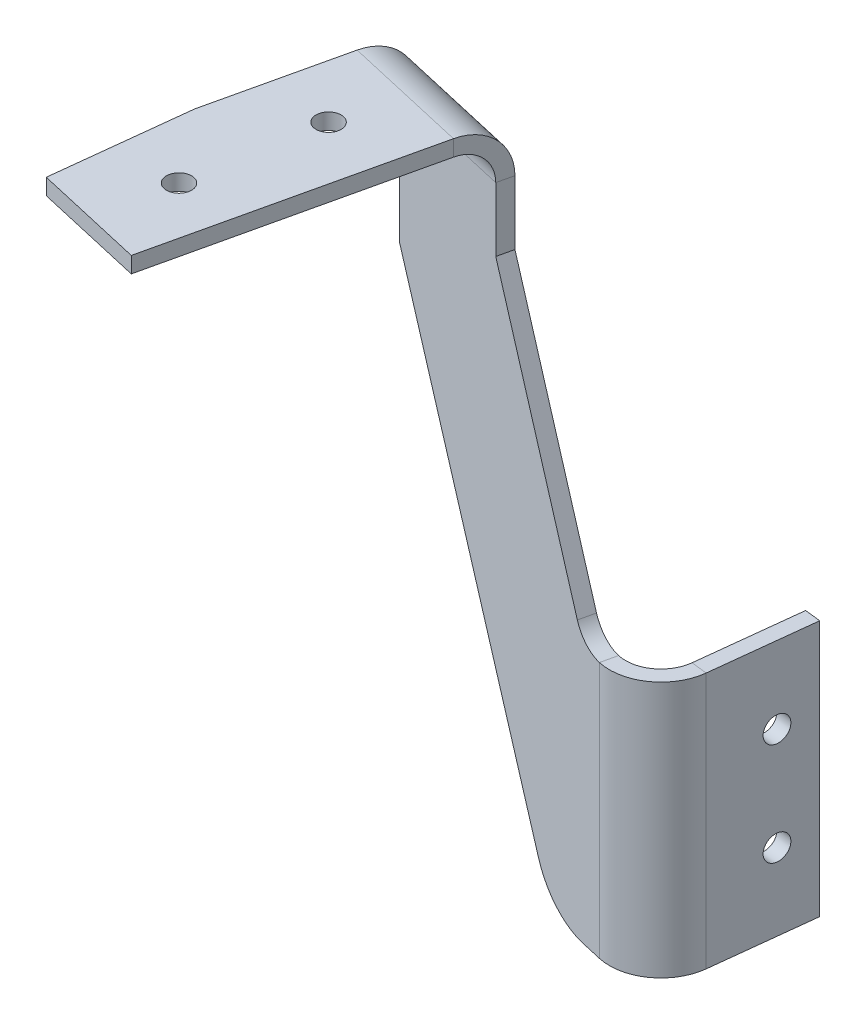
ISO-10303-21;
HEADER;
FILE_DESCRIPTION(('STEP AP214'),'2;1');
FILE_NAME('part.step','',(''),(''),'','','');
FILE_SCHEMA(('AUTOMOTIVE_DESIGN { 1 0 10303 214 1 1 1 1 }'));
ENDSEC;
DATA;
#1=APPLICATION_CONTEXT('core data for automotive mechanical design processes');
#2=APPLICATION_PROTOCOL_DEFINITION('international standard','automotive_design',2000,#1);
#3=PRODUCT_CONTEXT('',#1,'mechanical');
#4=PRODUCT('Part','Part','',(#3));
#5=PRODUCT_RELATED_PRODUCT_CATEGORY('part','',(#4));
#6=PRODUCT_DEFINITION_FORMATION('','',#4);
#7=PRODUCT_DEFINITION_CONTEXT('part definition',#1,'design');
#8=PRODUCT_DEFINITION('design','',#6,#7);
#9=PRODUCT_DEFINITION_SHAPE('','',#8);
#10=(LENGTH_UNIT() NAMED_UNIT(*) SI_UNIT(.MILLI.,.METRE.));
#11=(NAMED_UNIT(*) PLANE_ANGLE_UNIT() SI_UNIT($,.RADIAN.));
#12=(NAMED_UNIT(*) SI_UNIT($,.STERADIAN.) SOLID_ANGLE_UNIT());
#13=UNCERTAINTY_MEASURE_WITH_UNIT(LENGTH_MEASURE(1.E-05),#10,'distance_accuracy_value','');
#14=(GEOMETRIC_REPRESENTATION_CONTEXT(3) GLOBAL_UNCERTAINTY_ASSIGNED_CONTEXT((#13)) GLOBAL_UNIT_ASSIGNED_CONTEXT((#10,
#11,#12)) REPRESENTATION_CONTEXT('',''));
#15=CARTESIAN_POINT('',(0.,0.,0.));
#16=DIRECTION('',(0.,0.,1.));
#17=DIRECTION('',(1.,0.,0.));
#18=AXIS2_PLACEMENT_3D('',#15,#16,#17);
#19=CARTESIAN_POINT('',(-87.3403864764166,101.6,47.6895179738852));
#20=DIRECTION('',(-0.97483906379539,0.,-0.222909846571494));
#21=DIRECTION('',(0.222909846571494,0.,-0.97483906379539));
#22=AXIS2_PLACEMENT_3D('',#19,#20,#21);
#23=PLANE('',#22);
#24=DIRECTION('',(-0.222909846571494,0.,0.97483906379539));
#25=VECTOR('',#24,1.);
#26=CARTESIAN_POINT('',(-87.3403864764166,101.6,47.6895179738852));
#27=LINE('',#26,#25);
#28=CARTESIAN_POINT('',(-75.4537189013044,101.6,-4.29377513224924));
#29=VERTEX_POINT('',#28);
#30=CARTESIAN_POINT('',(-81.4497000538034,101.6,21.9281111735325));
#31=VERTEX_POINT('',#30);
#32=EDGE_CURVE('E179',#29,#31,#27,.T.);
#33=ORIENTED_EDGE('',*,*,#32,.F.);
#34=DIRECTION('',(0.,1.,0.));
#35=VECTOR('',#34,1.);
#36=CARTESIAN_POINT('',(-75.4537189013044,101.6,-4.29377513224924));
#37=LINE('',#36,#35);
#38=CARTESIAN_POINT('',(-75.4537189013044,98.4250000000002,-4.29377513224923));
#39=VERTEX_POINT('',#38);
#40=EDGE_CURVE('E209',#39,#29,#37,.T.);
#41=ORIENTED_EDGE('',*,*,#40,.F.);
#42=DIRECTION('',(0.222909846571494,0.,-0.97483906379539));
#43=VECTOR('',#42,1.);
#44=CARTESIAN_POINT('',(-73.1856112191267,98.4250000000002,-14.2127625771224));
#45=LINE('',#44,#43);
#46=CARTESIAN_POINT('',(-81.4497000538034,98.4250000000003,21.9281111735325));
#47=VERTEX_POINT('',#46);
#48=EDGE_CURVE('E181',#39,#47,#45,.F.);
#49=ORIENTED_EDGE('',*,*,#48,.T.);
#50=DIRECTION('',(0.,-1.,0.));
#51=VECTOR('',#50,1.);
#52=CARTESIAN_POINT('',(-81.4497000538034,98.4250000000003,21.9281111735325));
#53=LINE('',#52,#51);
#54=EDGE_CURVE('E167',#47,#31,#53,.F.);
#55=ORIENTED_EDGE('',*,*,#54,.T.);
#56=EDGE_LOOP('',(#33,#41,#49,#55));
#57=FACE_BOUND('',#56,.T.);
#58=ADVANCED_FACE('F39',(#57),#23,.T.);
#59=CARTESIAN_POINT('',(-21.7819574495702,101.6,-2.45863720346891));
#60=DIRECTION('',(0.,1.,0.));
#61=DIRECTION('',(-0.222909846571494,0.,0.97483906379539));
#62=AXIS2_PLACEMENT_3D('',#59,#60,#61);
#63=PLANE('',#62);
#64=CARTESIAN_POINT('',(-70.2788475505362,101.6,36.1898699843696));
#65=DIRECTION('',(0.,1.,0.));
#66=DIRECTION('',(0.222909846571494,0.,-0.97483906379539));
#67=AXIS2_PLACEMENT_3D('',#64,#65,#66);
#68=CIRCLE('',#67,2.4892);
#69=CARTESIAN_POINT('',(-69.7239803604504,101.6,33.7633005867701));
#70=VERTEX_POINT('',#69);
#71=EDGE_CURVE('E182',#70,#70,#68,.T.);
#72=ORIENTED_EDGE('',*,*,#71,.F.);
#73=EDGE_LOOP('',(#72));
#74=FACE_BOUND('',#73,.T.);
#75=CARTESIAN_POINT('',(-65.9042178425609,101.6,10.9176360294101));
#76=DIRECTION('',(0.,-1.,0.));
#77=DIRECTION('',(-0.222909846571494,0.,0.97483906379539));
#78=AXIS2_PLACEMENT_3D('',#75,#76,#77);
#79=CIRCLE('',#78,2.4892);
#80=CARTESIAN_POINT('',(-66.4590850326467,101.6,13.3442054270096));
#81=VERTEX_POINT('',#80);
#82=EDGE_CURVE('E289',#81,#81,#79,.T.);
#83=ORIENTED_EDGE('',*,*,#82,.T.);
#84=EDGE_LOOP('',(#83));
#85=FACE_BOUND('',#84,.T.);
#86=DIRECTION('',(0.97483906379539,0.,0.222909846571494));
#87=VECTOR('',#86,1.);
#88=CARTESIAN_POINT('',(-62.5794742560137,101.6,53.3514280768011));
#89=LINE('',#88,#87);
#90=CARTESIAN_POINT('',(-84.432569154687,101.6,48.354428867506));
#91=VERTEX_POINT('',#90);
#92=CARTESIAN_POINT('',(-62.5794742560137,101.6,53.3514280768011));
#93=VERTEX_POINT('',#92);
#94=EDGE_CURVE('E190',#91,#93,#89,.T.);
#95=ORIENTED_EDGE('',*,*,#94,.T.);
#96=DIRECTION('',(0.222909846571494,0.,-0.97483906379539));
#97=VECTOR('',#96,1.);
#98=CARTESIAN_POINT('',(-49.1324377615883,101.6,-5.45573844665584));
#99=LINE('',#98,#97);
#100=CARTESIAN_POINT('',(-50.6928066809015,101.6,1.3681349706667));
#101=VERTEX_POINT('',#100);
#102=EDGE_CURVE('E193',#93,#101,#99,.T.);
#103=ORIENTED_EDGE('',*,*,#102,.T.);
#104=DIRECTION('',(0.97483906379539,0.,0.222909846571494));
#105=VECTOR('',#104,1.);
#106=CARTESIAN_POINT('',(-24.0500651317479,101.6,7.46035024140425));
#107=LINE('',#106,#105);
#108=EDGE_CURVE('E188',#29,#101,#107,.T.);
#109=ORIENTED_EDGE('',*,*,#108,.F.);
#110=ORIENTED_EDGE('',*,*,#32,.T.);
#111=DIRECTION('',(-0.112162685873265,0.,0.993689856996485));
#112=VECTOR('',#111,1.);
#113=CARTESIAN_POINT('',(-77.9810287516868,101.6,-8.80210416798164));
#114=LINE('',#113,#112);
#115=EDGE_CURVE('E163',#31,#91,#114,.T.);
#116=ORIENTED_EDGE('',*,*,#115,.T.);
#117=EDGE_LOOP('',(#95,#103,#109,#110,#116));
#118=FACE_BOUND('',#117,.T.);
#119=ADVANCED_FACE('F185',(#74,#85,#118),#63,.T.);
#120=CARTESIAN_POINT('',(-21.7819574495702,98.4250000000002,-2.4586372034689));
#121=DIRECTION('',(0.,1.,0.));
#122=DIRECTION('',(-0.222909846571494,0.,0.97483906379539));
#123=AXIS2_PLACEMENT_3D('',#120,#121,#122);
#124=PLANE('',#123);
#125=CARTESIAN_POINT('',(-65.9042178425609,98.4250000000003,10.9176360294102));
#126=DIRECTION('',(0.,-1.,0.));
#127=DIRECTION('',(-0.222909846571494,0.,0.97483906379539));
#128=AXIS2_PLACEMENT_3D('',#125,#126,#127);
#129=CIRCLE('',#128,2.4892);
#130=CARTESIAN_POINT('',(-66.4590850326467,98.4250000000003,13.3442054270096));
#131=VERTEX_POINT('',#130);
#132=EDGE_CURVE('E285',#131,#131,#129,.T.);
#133=ORIENTED_EDGE('',*,*,#132,.F.);
#134=EDGE_LOOP('',(#133));
#135=FACE_BOUND('',#134,.T.);
#136=CARTESIAN_POINT('',(-70.2788475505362,98.4250000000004,36.1898699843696));
#137=DIRECTION('',(0.,1.,0.));
#138=DIRECTION('',(0.222909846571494,0.,-0.97483906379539));
#139=AXIS2_PLACEMENT_3D('',#136,#137,#138);
#140=CIRCLE('',#139,2.4892);
#141=CARTESIAN_POINT('',(-69.7239803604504,98.4250000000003,33.7633005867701));
#142=VERTEX_POINT('',#141);
#143=EDGE_CURVE('E375',#142,#142,#140,.T.);
#144=ORIENTED_EDGE('',*,*,#143,.T.);
#145=EDGE_LOOP('',(#144));
#146=FACE_BOUND('',#145,.T.);
#147=DIRECTION('',(-0.112162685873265,0.,0.993689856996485));
#148=VECTOR('',#147,1.);
#149=CARTESIAN_POINT('',(-77.9810287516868,98.4250000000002,-8.80210416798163));
#150=LINE('',#149,#148);
#151=CARTESIAN_POINT('',(-84.432569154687,98.4250000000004,48.354428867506));
#152=VERTEX_POINT('',#151);
#153=EDGE_CURVE('E174',#47,#152,#150,.T.);
#154=ORIENTED_EDGE('',*,*,#153,.F.);
#155=ORIENTED_EDGE('',*,*,#48,.F.);
#156=DIRECTION('',(-0.97483906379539,0.,-0.222909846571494));
#157=VECTOR('',#156,1.);
#158=CARTESIAN_POINT('',(-75.4537189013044,98.4250000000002,-4.29377513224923));
#159=LINE('',#158,#157);
#160=CARTESIAN_POINT('',(-50.6928066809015,98.4250000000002,1.36813497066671));
#161=VERTEX_POINT('',#160);
#162=EDGE_CURVE('E206',#39,#161,#159,.F.);
#163=ORIENTED_EDGE('',*,*,#162,.T.);
#164=DIRECTION('',(-0.222909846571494,0.,0.97483906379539));
#165=VECTOR('',#164,1.);
#166=CARTESIAN_POINT('',(-48.4246989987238,98.4250000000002,-8.55085247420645));
#167=LINE('',#166,#165);
#168=CARTESIAN_POINT('',(-62.5794742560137,98.4250000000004,53.3514280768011));
#169=VERTEX_POINT('',#168);
#170=EDGE_CURVE('E191',#169,#161,#167,.F.);
#171=ORIENTED_EDGE('',*,*,#170,.F.);
#172=DIRECTION('',(-0.97483906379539,0.,-0.222909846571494));
#173=VECTOR('',#172,1.);
#174=CARTESIAN_POINT('',(-35.9367327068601,98.4250000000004,59.4436433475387));
#175=LINE('',#174,#173);
#176=EDGE_CURVE('E196',#152,#169,#175,.F.);
#177=ORIENTED_EDGE('',*,*,#176,.F.);
#178=EDGE_LOOP('',(#154,#155,#163,#171,#177));
#179=FACE_BOUND('',#178,.T.);
#180=ADVANCED_FACE('F371',(#135,#146,#179),#124,.F.);
#181=CARTESIAN_POINT('',(-62.5794742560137,101.6,53.3514280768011));
#182=DIRECTION('',(-0.222909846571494,0.,0.97483906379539));
#183=DIRECTION('',(0.,-1.,0.));
#184=AXIS2_PLACEMENT_3D('',#181,#182,#183);
#185=PLANE('',#184);
#186=ORIENTED_EDGE('',*,*,#176,.T.);
#187=DIRECTION('',(0.,-1.,0.));
#188=VECTOR('',#187,1.);
#189=CARTESIAN_POINT('',(-62.5794742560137,101.6,53.3514280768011));
#190=LINE('',#189,#188);
#191=EDGE_CURVE('E227',#93,#169,#190,.T.);
#192=ORIENTED_EDGE('',*,*,#191,.F.);
#193=ORIENTED_EDGE('',*,*,#94,.F.);
#194=DIRECTION('',(0.,-1.,0.));
#195=VECTOR('',#194,1.);
#196=CARTESIAN_POINT('',(-84.432569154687,98.4250000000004,48.354428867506));
#197=LINE('',#196,#195);
#198=EDGE_CURVE('E169',#152,#91,#197,.F.);
#199=ORIENTED_EDGE('',*,*,#198,.F.);
#200=EDGE_LOOP('',(#186,#192,#193,#199));
#201=FACE_BOUND('',#200,.T.);
#202=ADVANCED_FACE('F418',(#201),#185,.T.);
#203=CARTESIAN_POINT('',(-21.7819574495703,31.75,-2.45863720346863));
#204=DIRECTION('',(0.222909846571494,0.,-0.97483906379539));
#205=DIRECTION('',(0.97483906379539,0.,0.222909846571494));
#206=AXIS2_PLACEMENT_3D('',#203,#204,#205);
#207=CYLINDRICAL_SURFACE('',#206,6.35);
#208=DIRECTION('',(0.222909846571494,0.,-0.97483906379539));
#209=VECTOR('',#208,1.);
#210=CARTESIAN_POINT('',(-21.7819574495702,25.4,-2.45863720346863));
#211=LINE('',#210,#209);
#212=CARTESIAN_POINT('',(-22.4896962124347,25.4,0.636476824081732));
#213=VERTEX_POINT('',#212);
#214=CARTESIAN_POINT('',(-21.7819574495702,25.4,-2.45863720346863));
#215=VERTEX_POINT('',#214);
#216=EDGE_CURVE('E279',#213,#215,#211,.T.);
#217=ORIENTED_EDGE('',*,*,#216,.T.);
#218=CARTESIAN_POINT('',(-21.7819574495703,31.75,-2.45863720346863));
#219=DIRECTION('',(-0.222909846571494,0.,0.97483906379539));
#220=DIRECTION('',(-0.97483906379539,0.,-0.222909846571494));
#221=AXIS2_PLACEMENT_3D('',#218,#219,#220);
#222=CIRCLE('',#221,6.35);
#223=CARTESIAN_POINT('',(-27.4598468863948,29.220489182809,-3.75696172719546));
#224=VERTEX_POINT('',#223);
#225=EDGE_CURVE('E245',#224,#215,#222,.T.);
#226=ORIENTED_EDGE('',*,*,#225,.F.);
#227=DIRECTION('',(0.222909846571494,0.,-0.97483906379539));
#228=VECTOR('',#227,1.);
#229=CARTESIAN_POINT('',(-27.4598468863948,29.220489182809,-3.75696172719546));
#230=LINE('',#229,#228);
#231=CARTESIAN_POINT('',(-28.1675856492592,29.220489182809,-0.661847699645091));
#232=VERTEX_POINT('',#231);
#233=EDGE_CURVE('E276',#232,#224,#230,.T.);
#234=ORIENTED_EDGE('',*,*,#233,.F.);
#235=CARTESIAN_POINT('',(-22.4896962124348,31.75,0.636476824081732));
#236=DIRECTION('',(-0.222909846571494,0.,0.97483906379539));
#237=DIRECTION('',(0.97483906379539,0.,0.222909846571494));
#238=AXIS2_PLACEMENT_3D('',#235,#236,#237);
#239=CIRCLE('',#238,6.35);
#240=EDGE_CURVE('E265',#232,#213,#239,.T.);
#241=ORIENTED_EDGE('',*,*,#240,.T.);
#242=EDGE_LOOP('',(#217,#226,#234,#241));
#243=FACE_BOUND('',#242,.T.);
#244=ADVANCED_FACE('F313',(#243),#207,.F.);
#245=CARTESIAN_POINT('',(-48.4246989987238,78.74,-8.55085247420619));
#246=DIRECTION('',(0.894155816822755,0.398348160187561,0.20446055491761));
#247=DIRECTION('',(0.388325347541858,-0.917234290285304,0.0887957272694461));
#248=AXIS2_PLACEMENT_3D('',#245,#246,#247);
#249=PLANE('',#248);
#250=ORIENTED_EDGE('',*,*,#233,.T.);
#251=DIRECTION('',(0.388325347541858,-0.917234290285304,0.0887957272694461));
#252=VECTOR('',#251,1.);
#253=CARTESIAN_POINT('',(-48.4246989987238,78.74,-8.55085247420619));
#254=LINE('',#253,#252);
#255=CARTESIAN_POINT('',(-48.4246989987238,78.74,-8.5508524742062));
#256=VERTEX_POINT('',#255);
#257=EDGE_CURVE('E248',#256,#224,#254,.T.);
#258=ORIENTED_EDGE('',*,*,#257,.F.);
#259=DIRECTION('',(0.222909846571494,0.,-0.97483906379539));
#260=VECTOR('',#259,1.);
#261=CARTESIAN_POINT('',(-48.4246989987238,78.74,-8.55085247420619));
#262=LINE('',#261,#260);
#263=CARTESIAN_POINT('',(-49.1324377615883,78.74,-5.45573844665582));
#264=VERTEX_POINT('',#263);
#265=EDGE_CURVE('E273',#264,#256,#262,.T.);
#266=ORIENTED_EDGE('',*,*,#265,.F.);
#267=DIRECTION('',(0.388325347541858,-0.917234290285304,0.0887957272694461));
#268=VECTOR('',#267,1.);
#269=CARTESIAN_POINT('',(-49.1324377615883,78.74,-5.45573844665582));
#270=LINE('',#269,#268);
#271=EDGE_CURVE('E263',#264,#232,#270,.T.);
#272=ORIENTED_EDGE('',*,*,#271,.T.);
#273=EDGE_LOOP('',(#250,#258,#266,#272));
#274=FACE_BOUND('',#273,.T.);
#275=ADVANCED_FACE('F339',(#274),#249,.T.);
#276=CARTESIAN_POINT('',(-73.1856112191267,66.0399999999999,-14.2127625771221));
#277=DIRECTION('',(-0.97483906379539,0.,-0.222909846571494));
#278=DIRECTION('',(0.,1.,0.));
#279=AXIS2_PLACEMENT_3D('',#276,#277,#278);
#280=PLANE('',#279);
#281=DIRECTION('',(0.,1.,0.));
#282=VECTOR('',#281,1.);
#283=CARTESIAN_POINT('',(-73.1856112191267,66.0399999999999,-14.2127625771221));
#284=LINE('',#283,#282);
#285=CARTESIAN_POINT('',(-73.1856112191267,66.0399999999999,-14.2127625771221));
#286=VERTEX_POINT('',#285);
#287=CARTESIAN_POINT('',(-73.1856112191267,91.4250000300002,-14.2127625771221));
#288=VERTEX_POINT('',#287);
#289=EDGE_CURVE('E250',#286,#288,#284,.T.);
#290=ORIENTED_EDGE('',*,*,#289,.F.);
#291=DIRECTION('',(0.222909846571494,0.,-0.97483906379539));
#292=VECTOR('',#291,1.);
#293=CARTESIAN_POINT('',(-73.1856112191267,66.0399999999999,-14.2127625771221));
#294=LINE('',#293,#292);
#295=CARTESIAN_POINT('',(-73.8933499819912,66.0399999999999,-11.1176485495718));
#296=VERTEX_POINT('',#295);
#297=EDGE_CURVE('E270',#296,#286,#294,.T.);
#298=ORIENTED_EDGE('',*,*,#297,.F.);
#299=DIRECTION('',(0.,1.,0.));
#300=VECTOR('',#299,1.);
#301=CARTESIAN_POINT('',(-73.8933499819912,31.75,-11.1176485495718));
#302=LINE('',#301,#300);
#303=CARTESIAN_POINT('',(-73.8933499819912,91.4250000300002,-11.1176485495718));
#304=VERTEX_POINT('',#303);
#305=EDGE_CURVE('E260',#296,#304,#302,.T.);
#306=ORIENTED_EDGE('',*,*,#305,.T.);
#307=DIRECTION('',(0.222909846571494,0.,-0.97483906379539));
#308=VECTOR('',#307,1.);
#309=CARTESIAN_POINT('',(-73.8933499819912,91.4250000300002,-11.1176485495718));
#310=LINE('',#309,#308);
#311=EDGE_CURVE('E228',#304,#288,#310,.T.);
#312=ORIENTED_EDGE('',*,*,#311,.T.);
#313=EDGE_LOOP('',(#290,#298,#306,#312));
#314=FACE_BOUND('',#313,.T.);
#315=ADVANCED_FACE('F358',(#314),#280,.T.);
#316=CARTESIAN_POINT('',(-34.1624135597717,-25.4,-5.2895922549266));
#317=DIRECTION('',(-0.893014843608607,-0.401032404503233,-0.204199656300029));
#318=DIRECTION('',(-0.390942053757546,0.916063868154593,-0.0893940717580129));
#319=AXIS2_PLACEMENT_3D('',#316,#317,#318);
#320=PLANE('',#319);
#321=DIRECTION('',(-0.390942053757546,0.916063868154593,-0.0893940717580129));
#322=VECTOR('',#321,1.);
#323=CARTESIAN_POINT('',(-34.8701523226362,-25.4,-2.19447822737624));
#324=LINE('',#323,#322);
#325=CARTESIAN_POINT('',(-38.1164899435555,-17.7931115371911,-2.93679626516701));
#326=VERTEX_POINT('',#325);
#327=EDGE_CURVE('E242',#326,#296,#324,.T.);
#328=ORIENTED_EDGE('',*,*,#327,.T.);
#329=ORIENTED_EDGE('',*,*,#297,.T.);
#330=DIRECTION('',(-0.390942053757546,0.916063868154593,-0.0893940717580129));
#331=VECTOR('',#330,1.);
#332=CARTESIAN_POINT('',(-34.1624135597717,-25.4,-5.2895922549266));
#333=LINE('',#332,#331);
#334=CARTESIAN_POINT('',(-37.408751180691,-17.7931115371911,-6.03191029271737));
#335=VERTEX_POINT('',#334);
#336=EDGE_CURVE('E253',#335,#286,#333,.T.);
#337=ORIENTED_EDGE('',*,*,#336,.F.);
#338=DIRECTION('',(0.222909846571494,0.,-0.97483906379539));
#339=VECTOR('',#338,1.);
#340=CARTESIAN_POINT('',(-37.408751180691,-17.7931115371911,-6.03191029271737));
#341=LINE('',#340,#339);
#342=EDGE_CURVE('E282',#326,#335,#341,.T.);
#343=ORIENTED_EDGE('',*,*,#342,.F.);
#344=EDGE_LOOP('',(#328,#329,#337,#343));
#345=FACE_BOUND('',#344,.T.);
#346=ADVANCED_FACE('F360',(#345),#320,.T.);
#347=CARTESIAN_POINT('',(-21.7819574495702,-25.4,-2.45863720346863));
#348=DIRECTION('',(0.,-1.,0.));
#349=DIRECTION('',(-0.97483906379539,0.,-0.222909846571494));
#350=AXIS2_PLACEMENT_3D('',#347,#348,#349);
#351=PLANE('',#350);
#352=DIRECTION('',(-0.97483906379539,0.,-0.222909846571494));
#353=VECTOR('',#352,1.);
#354=CARTESIAN_POINT('',(-21.7819574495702,-25.4,-2.45863720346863));
#355=LINE('',#354,#353);
#356=CARTESIAN_POINT('',(-21.7819574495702,-25.4,-2.45863720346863));
#357=VERTEX_POINT('',#356);
#358=CARTESIAN_POINT('',(-26.0674626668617,-25.4,-3.438574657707));
#359=VERTEX_POINT('',#358);
#360=EDGE_CURVE('E238',#357,#359,#355,.T.);
#361=ORIENTED_EDGE('',*,*,#360,.F.);
#362=DIRECTION('',(0.222909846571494,0.,-0.97483906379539));
#363=VECTOR('',#362,1.);
#364=CARTESIAN_POINT('',(-21.7819574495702,-25.4,-2.45863720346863));
#365=LINE('',#364,#363);
#366=CARTESIAN_POINT('',(-22.4896962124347,-25.4,0.636476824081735));
#367=VERTEX_POINT('',#366);
#368=EDGE_CURVE('E255',#367,#357,#365,.T.);
#369=ORIENTED_EDGE('',*,*,#368,.F.);
#370=DIRECTION('',(-0.97483906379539,0.,-0.222909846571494));
#371=VECTOR('',#370,1.);
#372=CARTESIAN_POINT('',(-22.4896962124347,-25.4,0.636476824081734));
#373=LINE('',#372,#371);
#374=CARTESIAN_POINT('',(-26.7752014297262,-25.4,-0.343460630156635));
#375=VERTEX_POINT('',#374);
#376=EDGE_CURVE('E237',#367,#375,#373,.T.);
#377=ORIENTED_EDGE('',*,*,#376,.T.);
#378=DIRECTION('',(0.222909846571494,0.,-0.97483906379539));
#379=VECTOR('',#378,1.);
#380=CARTESIAN_POINT('',(-26.0674626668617,-25.4,-3.438574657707));
#381=LINE('',#380,#379);
#382=EDGE_CURVE('E47',#359,#375,#381,.F.);
#383=ORIENTED_EDGE('',*,*,#382,.F.);
#384=EDGE_LOOP('',(#361,#369,#377,#383));
#385=FACE_BOUND('',#384,.T.);
#386=ADVANCED_FACE('F303',(#385),#351,.T.);
#387=CARTESIAN_POINT('',(-21.7819574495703,31.75,-2.45863720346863));
#388=DIRECTION('',(-0.222909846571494,0.,0.97483906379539));
#389=DIRECTION('',(-0.97483906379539,0.,-0.222909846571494));
#390=AXIS2_PLACEMENT_3D('',#387,#388,#389);
#391=PLANE('',#390);
#392=ORIENTED_EDGE('',*,*,#336,.T.);
#393=ORIENTED_EDGE('',*,*,#289,.T.);
#394=DIRECTION('',(0.97483906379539,0.,0.222909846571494));
#395=VECTOR('',#394,1.);
#396=CARTESIAN_POINT('',(-48.4246989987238,91.4250000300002,-8.5508524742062));
#397=LINE('',#396,#395);
#398=CARTESIAN_POINT('',(-48.4246989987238,91.4250000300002,-8.5508524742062));
#399=VERTEX_POINT('',#398);
#400=EDGE_CURVE('E212',#399,#288,#397,.F.);
#401=ORIENTED_EDGE('',*,*,#400,.F.);
#402=DIRECTION('',(0.,-1.,0.));
#403=VECTOR('',#402,1.);
#404=CARTESIAN_POINT('',(-48.4246989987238,91.4250000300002,-8.5508524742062));
#405=LINE('',#404,#403);
#406=EDGE_CURVE('E231',#399,#256,#405,.T.);
#407=ORIENTED_EDGE('',*,*,#406,.T.);
#408=ORIENTED_EDGE('',*,*,#257,.T.);
#409=ORIENTED_EDGE('',*,*,#225,.T.);
#410=DIRECTION('',(0.,-1.,0.));
#411=VECTOR('',#410,1.);
#412=CARTESIAN_POINT('',(-21.7819574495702,-25.4,-2.45863720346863));
#413=LINE('',#412,#411);
#414=EDGE_CURVE('E241',#215,#357,#413,.T.);
#415=ORIENTED_EDGE('',*,*,#414,.T.);
#416=ORIENTED_EDGE('',*,*,#360,.T.);
#417=CARTESIAN_POINT('',(-26.0674626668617,-12.7,-3.438574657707));
#418=DIRECTION('',(0.222909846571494,0.,-0.97483906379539));
#419=DIRECTION('',(-0.97483906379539,0.,-0.222909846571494));
#420=AXIS2_PLACEMENT_3D('',#417,#418,#419);
#421=CIRCLE('',#420,12.7);
#422=EDGE_CURVE('E59',#335,#359,#421,.F.);
#423=ORIENTED_EDGE('',*,*,#422,.F.);
#424=EDGE_LOOP('',(#392,#393,#401,#407,#408,#409,#415,#416,#423));
#425=FACE_BOUND('',#424,.T.);
#426=ADVANCED_FACE('F333',(#425),#391,.F.);
#427=CARTESIAN_POINT('',(-22.4896962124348,31.75,0.636476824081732));
#428=DIRECTION('',(-0.222909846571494,0.,0.97483906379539));
#429=DIRECTION('',(-0.97483906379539,0.,-0.222909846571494));
#430=AXIS2_PLACEMENT_3D('',#427,#428,#429);
#431=PLANE('',#430);
#432=ORIENTED_EDGE('',*,*,#376,.F.);
#433=DIRECTION('',(0.,1.,0.));
#434=VECTOR('',#433,1.);
#435=CARTESIAN_POINT('',(-22.4896962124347,31.75,0.636476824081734));
#436=LINE('',#435,#434);
#437=EDGE_CURVE('E258',#213,#367,#436,.F.);
#438=ORIENTED_EDGE('',*,*,#437,.F.);
#439=ORIENTED_EDGE('',*,*,#240,.F.);
#440=ORIENTED_EDGE('',*,*,#271,.F.);
#441=DIRECTION('',(0.,-1.,0.));
#442=VECTOR('',#441,1.);
#443=CARTESIAN_POINT('',(-49.1324377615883,91.4250000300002,-5.45573844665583));
#444=LINE('',#443,#442);
#445=CARTESIAN_POINT('',(-49.1324377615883,91.4250000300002,-5.45573844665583));
#446=VERTEX_POINT('',#445);
#447=EDGE_CURVE('E235',#446,#264,#444,.T.);
#448=ORIENTED_EDGE('',*,*,#447,.F.);
#449=DIRECTION('',(0.97483906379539,0.,0.222909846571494));
#450=VECTOR('',#449,1.);
#451=CARTESIAN_POINT('',(-49.1324377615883,91.4250000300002,-5.45573844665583));
#452=LINE('',#451,#450);
#453=EDGE_CURVE('E222',#446,#304,#452,.F.);
#454=ORIENTED_EDGE('',*,*,#453,.T.);
#455=ORIENTED_EDGE('',*,*,#305,.F.);
#456=ORIENTED_EDGE('',*,*,#327,.F.);
#457=CARTESIAN_POINT('',(-26.7752014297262,-12.7,-0.343460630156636));
#458=DIRECTION('',(0.222909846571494,0.,-0.97483906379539));
#459=DIRECTION('',(-0.97483906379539,0.,-0.222909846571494));
#460=AXIS2_PLACEMENT_3D('',#457,#458,#459);
#461=CIRCLE('',#460,12.7);
#462=EDGE_CURVE('E11',#375,#326,#461,.T.);
#463=ORIENTED_EDGE('',*,*,#462,.F.);
#464=EDGE_LOOP('',(#432,#438,#439,#440,#448,#454,#455,#456,#463));
#465=FACE_BOUND('',#464,.T.);
#466=ADVANCED_FACE('F305',(#465),#431,.T.);
#467=CARTESIAN_POINT('',(-49.1324377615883,91.4250000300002,-5.45573844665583));
#468=DIRECTION('',(0.97483906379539,0.,0.222909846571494));
#469=DIRECTION('',(0.222909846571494,0.,-0.97483906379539));
#470=AXIS2_PLACEMENT_3D('',#467,#468,#469);
#471=PLANE('',#470);
#472=ORIENTED_EDGE('',*,*,#447,.T.);
#473=ORIENTED_EDGE('',*,*,#265,.T.);
#474=ORIENTED_EDGE('',*,*,#406,.F.);
#475=DIRECTION('',(0.222909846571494,0.,-0.97483906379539));
#476=VECTOR('',#475,1.);
#477=CARTESIAN_POINT('',(-49.1324377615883,91.4250000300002,-5.45573844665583));
#478=LINE('',#477,#476);
#479=EDGE_CURVE('E218',#446,#399,#478,.T.);
#480=ORIENTED_EDGE('',*,*,#479,.F.);
#481=EDGE_LOOP('',(#472,#473,#474,#480));
#482=FACE_BOUND('',#481,.T.);
#483=ADVANCED_FACE('F346',(#482),#471,.T.);
#484=CARTESIAN_POINT('',(-75.4537189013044,91.4250000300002,-4.2937751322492));
#485=DIRECTION('',(-0.97483906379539,0.,-0.222909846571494));
#486=DIRECTION('',(0.222909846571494,0.,-0.97483906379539));
#487=AXIS2_PLACEMENT_3D('',#484,#485,#486);
#488=PLANE('',#487);
#489=ORIENTED_EDGE('',*,*,#40,.T.);
#490=CARTESIAN_POINT('',(-75.4537189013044,91.4250000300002,-4.2937751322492));
#491=DIRECTION('',(-0.97483906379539,0.,-0.222909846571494));
#492=DIRECTION('',(-0.222909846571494,0.,0.97483906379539));
#493=AXIS2_PLACEMENT_3D('',#490,#491,#492);
#494=CIRCLE('',#493,10.17499997);
#495=EDGE_CURVE('E215',#288,#29,#494,.F.);
#496=ORIENTED_EDGE('',*,*,#495,.F.);
#497=ORIENTED_EDGE('',*,*,#311,.F.);
#498=CARTESIAN_POINT('',(-75.4537189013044,91.4250000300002,-4.2937751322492));
#499=DIRECTION('',(-0.97483906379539,0.,-0.222909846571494));
#500=DIRECTION('',(-0.222909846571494,0.,0.97483906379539));
#501=AXIS2_PLACEMENT_3D('',#498,#499,#500);
#502=CIRCLE('',#501,6.99999997);
#503=EDGE_CURVE('E220',#304,#39,#502,.F.);
#504=ORIENTED_EDGE('',*,*,#503,.T.);
#505=EDGE_LOOP('',(#489,#496,#497,#504));
#506=FACE_BOUND('',#505,.T.);
#507=ADVANCED_FACE('F354',(#506),#488,.T.);
#508=CARTESIAN_POINT('',(-50.6928066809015,91.4250000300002,1.36813497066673));
#509=DIRECTION('',(-0.97483906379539,0.,-0.222909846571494));
#510=DIRECTION('',(0.222909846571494,0.,-0.97483906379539));
#511=AXIS2_PLACEMENT_3D('',#508,#509,#510);
#512=PLANE('',#511);
#513=CARTESIAN_POINT('',(-50.6928066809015,91.4250000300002,1.36813497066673));
#514=DIRECTION('',(-0.97483906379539,0.,-0.222909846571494));
#515=DIRECTION('',(-0.222909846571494,0.,0.97483906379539));
#516=AXIS2_PLACEMENT_3D('',#513,#514,#515);
#517=CIRCLE('',#516,6.99999997);
#518=EDGE_CURVE('E225',#161,#446,#517,.T.);
#519=ORIENTED_EDGE('',*,*,#518,.T.);
#520=ORIENTED_EDGE('',*,*,#479,.T.);
#521=CARTESIAN_POINT('',(-50.6928066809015,91.4250000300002,1.36813497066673));
#522=DIRECTION('',(-0.97483906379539,0.,-0.222909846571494));
#523=DIRECTION('',(-0.222909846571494,0.,0.97483906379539));
#524=AXIS2_PLACEMENT_3D('',#521,#522,#523);
#525=CIRCLE('',#524,10.17499997);
#526=EDGE_CURVE('E216',#101,#399,#525,.T.);
#527=ORIENTED_EDGE('',*,*,#526,.F.);
#528=DIRECTION('',(0.,1.,0.));
#529=VECTOR('',#528,1.);
#530=CARTESIAN_POINT('',(-50.6928066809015,98.4250000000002,1.36813497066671));
#531=LINE('',#530,#529);
#532=EDGE_CURVE('E204',#161,#101,#531,.T.);
#533=ORIENTED_EDGE('',*,*,#532,.F.);
#534=EDGE_LOOP('',(#519,#520,#527,#533));
#535=FACE_BOUND('',#534,.T.);
#536=ADVANCED_FACE('F364',(#535),#512,.F.);
#537=CARTESIAN_POINT('',(-50.6928066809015,91.4250000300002,1.36813497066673));
#538=DIRECTION('',(0.97483906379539,0.,0.222909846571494));
#539=DIRECTION('',(0.,1.,0.));
#540=AXIS2_PLACEMENT_3D('',#537,#538,#539);
#541=CYLINDRICAL_SURFACE('',#540,10.17499997);
#542=ORIENTED_EDGE('',*,*,#400,.T.);
#543=ORIENTED_EDGE('',*,*,#495,.T.);
#544=ORIENTED_EDGE('',*,*,#108,.T.);
#545=ORIENTED_EDGE('',*,*,#526,.T.);
#546=EDGE_LOOP('',(#542,#543,#544,#545));
#547=FACE_BOUND('',#546,.T.);
#548=ADVANCED_FACE('F363',(#547),#541,.T.);
#549=CARTESIAN_POINT('',(-50.6928066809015,91.4250000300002,1.36813497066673));
#550=DIRECTION('',(0.97483906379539,0.,0.222909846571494));
#551=DIRECTION('',(0.,1.,0.));
#552=AXIS2_PLACEMENT_3D('',#549,#550,#551);
#553=CYLINDRICAL_SURFACE('',#552,6.99999997);
#554=ORIENTED_EDGE('',*,*,#453,.F.);
#555=ORIENTED_EDGE('',*,*,#518,.F.);
#556=ORIENTED_EDGE('',*,*,#162,.F.);
#557=ORIENTED_EDGE('',*,*,#503,.F.);
#558=EDGE_LOOP('',(#554,#555,#556,#557));
#559=FACE_BOUND('',#558,.T.);
#560=ADVANCED_FACE('F351',(#559),#553,.F.);
#561=CARTESIAN_POINT('',(-49.1324377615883,101.6,-5.45573844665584));
#562=DIRECTION('',(0.97483906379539,0.,0.222909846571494));
#563=DIRECTION('',(-0.222909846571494,0.,0.97483906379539));
#564=AXIS2_PLACEMENT_3D('',#561,#562,#563);
#565=PLANE('',#564);
#566=ORIENTED_EDGE('',*,*,#102,.F.);
#567=ORIENTED_EDGE('',*,*,#191,.T.);
#568=ORIENTED_EDGE('',*,*,#170,.T.);
#569=ORIENTED_EDGE('',*,*,#532,.T.);
#570=EDGE_LOOP('',(#566,#567,#568,#569));
#571=FACE_BOUND('',#570,.T.);
#572=ADVANCED_FACE('F367',(#571),#565,.T.);
#573=CARTESIAN_POINT('',(-20.2215885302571,-25.4,-9.28251062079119));
#574=DIRECTION('',(0.,-1.,0.));
#575=DIRECTION('',(-0.97483906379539,0.,-0.222909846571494));
#576=AXIS2_PLACEMENT_3D('',#573,#574,#575);
#577=PLANE('',#576);
#578=DIRECTION('',(0.993689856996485,0.,0.112162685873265));
#579=VECTOR('',#578,1.);
#580=CARTESIAN_POINT('',(-10.1107942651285,-25.4,-8.1412552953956));
#581=LINE('',#580,#579);
#582=CARTESIAN_POINT('',(-13.2657595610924,-25.4,-8.49737182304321));
#583=VERTEX_POINT('',#582);
#584=CARTESIAN_POINT('',(-10.1107942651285,-25.4,-8.14125529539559));
#585=VERTEX_POINT('',#584);
#586=EDGE_CURVE('E288',#583,#585,#581,.T.);
#587=ORIENTED_EDGE('',*,*,#586,.T.);
#588=CARTESIAN_POINT('',(-20.2215885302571,-25.4,-9.28251062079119));
#589=DIRECTION('',(0.,-1.,0.));
#590=DIRECTION('',(0.97483906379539,0.,0.222909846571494));
#591=AXIS2_PLACEMENT_3D('',#588,#589,#590);
#592=CIRCLE('',#591,10.17499997);
#593=EDGE_CURVE('E211',#367,#585,#592,.F.);
#594=ORIENTED_EDGE('',*,*,#593,.F.);
#595=ORIENTED_EDGE('',*,*,#368,.T.);
#596=CARTESIAN_POINT('',(-20.2215885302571,-25.4,-9.28251062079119));
#597=DIRECTION('',(0.,-1.,0.));
#598=DIRECTION('',(0.97483906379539,0.,0.222909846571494));
#599=AXIS2_PLACEMENT_3D('',#596,#597,#598);
#600=CIRCLE('',#599,6.99999997);
#601=EDGE_CURVE('E327',#357,#583,#600,.F.);
#602=ORIENTED_EDGE('',*,*,#601,.T.);
#603=EDGE_LOOP('',(#587,#594,#595,#602));
#604=FACE_BOUND('',#603,.T.);
#605=ADVANCED_FACE('F507',(#604),#577,.T.);
#606=CARTESIAN_POINT('',(-20.2215885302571,25.4,-9.28251062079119));
#607=DIRECTION('',(0.,-1.,0.));
#608=DIRECTION('',(-0.97483906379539,0.,-0.222909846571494));
#609=AXIS2_PLACEMENT_3D('',#606,#607,#608);
#610=PLANE('',#609);
#611=CARTESIAN_POINT('',(-20.2215885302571,25.4,-9.28251062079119));
#612=DIRECTION('',(0.,-1.,0.));
#613=DIRECTION('',(0.97483906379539,0.,0.222909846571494));
#614=AXIS2_PLACEMENT_3D('',#611,#612,#613);
#615=CIRCLE('',#614,6.99999997);
#616=CARTESIAN_POINT('',(-13.2657595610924,25.4,-8.49737182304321));
#617=VERTEX_POINT('',#616);
#618=EDGE_CURVE('E321',#617,#215,#615,.T.);
#619=ORIENTED_EDGE('',*,*,#618,.T.);
#620=ORIENTED_EDGE('',*,*,#216,.F.);
#621=CARTESIAN_POINT('',(-20.2215885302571,25.4,-9.28251062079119));
#622=DIRECTION('',(0.,-1.,0.));
#623=DIRECTION('',(0.97483906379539,0.,0.222909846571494));
#624=AXIS2_PLACEMENT_3D('',#621,#622,#623);
#625=CIRCLE('',#624,10.17499997);
#626=CARTESIAN_POINT('',(-10.1107942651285,25.4,-8.1412552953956));
#627=VERTEX_POINT('',#626);
#628=EDGE_CURVE('E319',#627,#213,#625,.T.);
#629=ORIENTED_EDGE('',*,*,#628,.F.);
#630=DIRECTION('',(0.993689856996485,0.,0.112162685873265));
#631=VECTOR('',#630,1.);
#632=CARTESIAN_POINT('',(-13.2657595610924,25.4,-8.49737182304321));
#633=LINE('',#632,#631);
#634=EDGE_CURVE('E324',#617,#627,#633,.T.);
#635=ORIENTED_EDGE('',*,*,#634,.F.);
#636=EDGE_LOOP('',(#619,#620,#629,#635));
#637=FACE_BOUND('',#636,.T.);
#638=ADVANCED_FACE('F317',(#637),#610,.F.);
#639=CARTESIAN_POINT('',(-20.2215885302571,25.4,-9.28251062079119));
#640=DIRECTION('',(0.,1.,0.));
#641=DIRECTION('',(0.993689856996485,0.,0.112162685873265));
#642=AXIS2_PLACEMENT_3D('',#639,#640,#641);
#643=CYLINDRICAL_SURFACE('',#642,10.17499997);
#644=ORIENTED_EDGE('',*,*,#437,.T.);
#645=ORIENTED_EDGE('',*,*,#593,.T.);
#646=DIRECTION('',(0.,1.,0.));
#647=VECTOR('',#646,1.);
#648=CARTESIAN_POINT('',(-10.1107942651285,0.,-8.1412552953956));
#649=LINE('',#648,#647);
#650=EDGE_CURVE('E405',#585,#627,#649,.T.);
#651=ORIENTED_EDGE('',*,*,#650,.T.);
#652=ORIENTED_EDGE('',*,*,#628,.T.);
#653=EDGE_LOOP('',(#644,#645,#651,#652));
#654=FACE_BOUND('',#653,.T.);
#655=ADVANCED_FACE('F520',(#654),#643,.T.);
#656=CARTESIAN_POINT('',(-20.2215885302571,25.4,-9.28251062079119));
#657=DIRECTION('',(0.,1.,0.));
#658=DIRECTION('',(0.993689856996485,0.,0.112162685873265));
#659=AXIS2_PLACEMENT_3D('',#656,#657,#658);
#660=CYLINDRICAL_SURFACE('',#659,6.99999997);
#661=ORIENTED_EDGE('',*,*,#414,.F.);
#662=ORIENTED_EDGE('',*,*,#618,.F.);
#663=DIRECTION('',(0.,-1.,0.));
#664=VECTOR('',#663,1.);
#665=CARTESIAN_POINT('',(-13.2657595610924,-25.4,-8.49737182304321));
#666=LINE('',#665,#664);
#667=EDGE_CURVE('E409',#583,#617,#666,.F.);
#668=ORIENTED_EDGE('',*,*,#667,.F.);
#669=ORIENTED_EDGE('',*,*,#601,.F.);
#670=EDGE_LOOP('',(#661,#662,#668,#669));
#671=FACE_BOUND('',#670,.T.);
#672=ADVANCED_FACE('F330',(#671),#660,.F.);
#673=CARTESIAN_POINT('',(-10.9895413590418,25.4,-0.356116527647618));
#674=DIRECTION('',(0.,1.,0.));
#675=DIRECTION('',(0.97483906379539,0.,0.222909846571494));
#676=AXIS2_PLACEMENT_3D('',#673,#674,#675);
#677=PLANE('',#676);
#678=DIRECTION('',(-0.112162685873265,0.,0.993689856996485));
#679=VECTOR('',#678,1.);
#680=CARTESIAN_POINT('',(-10.9895413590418,25.4,-0.356116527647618));
#681=LINE('',#680,#679);
#682=CARTESIAN_POINT('',(-7.82695065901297,25.4,-28.3746529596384));
#683=VERTEX_POINT('',#682);
#684=EDGE_CURVE('E391',#683,#627,#681,.T.);
#685=ORIENTED_EDGE('',*,*,#684,.F.);
#686=DIRECTION('',(-0.993689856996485,0.,-0.112162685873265));
#687=VECTOR('',#686,1.);
#688=CARTESIAN_POINT('',(-7.82695065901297,25.4,-28.3746529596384));
#689=LINE('',#688,#687);
#690=CARTESIAN_POINT('',(-10.9819159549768,25.4,-28.730769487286));
#691=VERTEX_POINT('',#690);
#692=EDGE_CURVE('E328',#683,#691,#689,.T.);
#693=ORIENTED_EDGE('',*,*,#692,.T.);
#694=DIRECTION('',(0.112162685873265,0.,-0.993689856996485));
#695=VECTOR('',#694,1.);
#696=CARTESIAN_POINT('',(-14.1445066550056,25.4,-0.712233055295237));
#697=LINE('',#696,#695);
#698=EDGE_CURVE('E398',#691,#617,#697,.F.);
#699=ORIENTED_EDGE('',*,*,#698,.T.);
#700=ORIENTED_EDGE('',*,*,#634,.T.);
#701=EDGE_LOOP('',(#685,#693,#699,#700));
#702=FACE_BOUND('',#701,.T.);
#703=ADVANCED_FACE('F533',(#702),#677,.T.);
#704=CARTESIAN_POINT('',(-7.82695065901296,-25.4,-28.3746529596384));
#705=DIRECTION('',(0.,-1.,0.));
#706=DIRECTION('',(-0.97483906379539,0.,-0.222909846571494));
#707=AXIS2_PLACEMENT_3D('',#704,#705,#706);
#708=PLANE('',#707);
#709=DIRECTION('',(-0.112162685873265,0.,0.993689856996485));
#710=VECTOR('',#709,1.);
#711=CARTESIAN_POINT('',(-14.1445066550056,-25.4,-0.712233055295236));
#712=LINE('',#711,#710);
#713=CARTESIAN_POINT('',(-10.9819159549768,-25.4,-28.730769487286));
#714=VERTEX_POINT('',#713);
#715=EDGE_CURVE('E402',#583,#714,#712,.F.);
#716=ORIENTED_EDGE('',*,*,#715,.T.);
#717=DIRECTION('',(-0.993689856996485,0.,-0.112162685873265));
#718=VECTOR('',#717,1.);
#719=CARTESIAN_POINT('',(-7.82695065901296,-25.4,-28.3746529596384));
#720=LINE('',#719,#718);
#721=CARTESIAN_POINT('',(-7.82695065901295,-25.4,-28.3746529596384));
#722=VERTEX_POINT('',#721);
#723=EDGE_CURVE('E388',#722,#714,#720,.T.);
#724=ORIENTED_EDGE('',*,*,#723,.F.);
#725=DIRECTION('',(0.112162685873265,0.,-0.993689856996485));
#726=VECTOR('',#725,1.);
#727=CARTESIAN_POINT('',(-7.82695065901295,-25.4,-28.3746529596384));
#728=LINE('',#727,#726);
#729=EDGE_CURVE('E395',#585,#722,#728,.T.);
#730=ORIENTED_EDGE('',*,*,#729,.F.);
#731=ORIENTED_EDGE('',*,*,#586,.F.);
#732=EDGE_LOOP('',(#716,#724,#730,#731));
#733=FACE_BOUND('',#732,.T.);
#734=ADVANCED_FACE('F540',(#733),#708,.T.);
#735=CARTESIAN_POINT('',(-10.9895413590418,0.,-0.356116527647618));
#736=DIRECTION('',(0.993689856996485,0.,0.112162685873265));
#737=DIRECTION('',(-0.112162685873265,0.,0.993689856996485));
#738=AXIS2_PLACEMENT_3D('',#735,#736,#737);
#739=PLANE('',#738);
#740=CARTESIAN_POINT('',(-8.68632815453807,-10.16,-20.761116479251));
#741=DIRECTION('',(-0.993689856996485,0.,-0.112162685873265));
#742=DIRECTION('',(-0.112162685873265,0.,0.993689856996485));
#743=AXIS2_PLACEMENT_3D('',#740,#741,#742);
#744=CIRCLE('',#743,2.4892);
#745=CARTESIAN_POINT('',(-8.96552351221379,-10.16,-18.2876236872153));
#746=VERTEX_POINT('',#745);
#747=EDGE_CURVE('E297',#746,#746,#744,.T.);
#748=ORIENTED_EDGE('',*,*,#747,.T.);
#749=EDGE_LOOP('',(#748));
#750=FACE_BOUND('',#749,.T.);
#751=CARTESIAN_POINT('',(-8.68632815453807,10.16,-20.761116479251));
#752=DIRECTION('',(-0.993689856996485,0.,-0.112162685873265));
#753=DIRECTION('',(-0.112162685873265,0.,0.993689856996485));
#754=AXIS2_PLACEMENT_3D('',#751,#752,#753);
#755=CIRCLE('',#754,2.4892);
#756=CARTESIAN_POINT('',(-8.9655235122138,10.16,-18.2876236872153));
#757=VERTEX_POINT('',#756);
#758=EDGE_CURVE('E293',#757,#757,#755,.T.);
#759=ORIENTED_EDGE('',*,*,#758,.T.);
#760=EDGE_LOOP('',(#759));
#761=FACE_BOUND('',#760,.T.);
#762=ORIENTED_EDGE('',*,*,#729,.T.);
#763=DIRECTION('',(0.,1.,0.));
#764=VECTOR('',#763,1.);
#765=CARTESIAN_POINT('',(-7.82695065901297,25.4,-28.3746529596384));
#766=LINE('',#765,#764);
#767=EDGE_CURVE('E393',#722,#683,#766,.T.);
#768=ORIENTED_EDGE('',*,*,#767,.T.);
#769=ORIENTED_EDGE('',*,*,#684,.T.);
#770=ORIENTED_EDGE('',*,*,#650,.F.);
#771=EDGE_LOOP('',(#762,#768,#769,#770));
#772=FACE_BOUND('',#771,.T.);
#773=ADVANCED_FACE('F548',(#750,#761,#772),#739,.T.);
#774=CARTESIAN_POINT('',(-14.1445066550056,0.,-0.712233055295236));
#775=DIRECTION('',(0.993689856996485,0.,0.112162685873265));
#776=DIRECTION('',(-0.112162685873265,0.,0.993689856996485));
#777=AXIS2_PLACEMENT_3D('',#774,#775,#776);
#778=PLANE('',#777);
#779=CARTESIAN_POINT('',(-11.8412934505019,-10.16,-21.1172330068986));
#780=DIRECTION('',(-0.993689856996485,0.,-0.112162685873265));
#781=DIRECTION('',(-0.112162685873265,0.,0.993689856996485));
#782=AXIS2_PLACEMENT_3D('',#779,#780,#781);
#783=CIRCLE('',#782,2.4892);
#784=CARTESIAN_POINT('',(-12.1204888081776,-10.16,-18.6437402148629));
#785=VERTEX_POINT('',#784);
#786=EDGE_CURVE('E294',#785,#785,#783,.T.);
#787=ORIENTED_EDGE('',*,*,#786,.F.);
#788=EDGE_LOOP('',(#787));
#789=FACE_BOUND('',#788,.T.);
#790=CARTESIAN_POINT('',(-11.8412934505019,10.16,-21.1172330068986));
#791=DIRECTION('',(-0.993689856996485,0.,-0.112162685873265));
#792=DIRECTION('',(-0.112162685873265,0.,0.993689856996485));
#793=AXIS2_PLACEMENT_3D('',#790,#791,#792);
#794=CIRCLE('',#793,2.4892);
#795=CARTESIAN_POINT('',(-12.1204888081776,10.16,-18.6437402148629));
#796=VERTEX_POINT('',#795);
#797=EDGE_CURVE('E290',#796,#796,#794,.T.);
#798=ORIENTED_EDGE('',*,*,#797,.F.);
#799=EDGE_LOOP('',(#798));
#800=FACE_BOUND('',#799,.T.);
#801=ORIENTED_EDGE('',*,*,#667,.T.);
#802=ORIENTED_EDGE('',*,*,#698,.F.);
#803=DIRECTION('',(0.,-1.,0.));
#804=VECTOR('',#803,1.);
#805=CARTESIAN_POINT('',(-10.9819159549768,0.,-28.730769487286));
#806=LINE('',#805,#804);
#807=EDGE_CURVE('E400',#714,#691,#806,.F.);
#808=ORIENTED_EDGE('',*,*,#807,.F.);
#809=ORIENTED_EDGE('',*,*,#715,.F.);
#810=EDGE_LOOP('',(#801,#802,#808,#809));
#811=FACE_BOUND('',#810,.T.);
#812=ADVANCED_FACE('F556',(#789,#800,#811),#778,.F.);
#813=CARTESIAN_POINT('',(-7.82695065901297,25.4,-28.3746529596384));
#814=DIRECTION('',(0.112162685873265,0.,-0.993689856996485));
#815=DIRECTION('',(0.993689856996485,0.,0.112162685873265));
#816=AXIS2_PLACEMENT_3D('',#813,#814,#815);
#817=PLANE('',#816);
#818=ORIENTED_EDGE('',*,*,#807,.T.);
#819=ORIENTED_EDGE('',*,*,#692,.F.);
#820=ORIENTED_EDGE('',*,*,#767,.F.);
#821=ORIENTED_EDGE('',*,*,#723,.T.);
#822=EDGE_LOOP('',(#818,#819,#820,#821));
#823=FACE_BOUND('',#822,.T.);
#824=ADVANCED_FACE('F564',(#823),#817,.T.);
#825=CARTESIAN_POINT('',(-65.9042178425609,-25.4000000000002,10.9176360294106));
#826=DIRECTION('',(0.,1.,0.));
#827=DIRECTION('',(-0.222909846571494,0.,0.97483906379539));
#828=AXIS2_PLACEMENT_3D('',#825,#826,#827);
#829=CYLINDRICAL_SURFACE('',#828,2.4892);
#830=ORIENTED_EDGE('',*,*,#82,.F.);
#831=EDGE_LOOP('',(#830));
#832=FACE_BOUND('',#831,.T.);
#833=ORIENTED_EDGE('',*,*,#132,.T.);
#834=EDGE_LOOP('',(#833));
#835=FACE_BOUND('',#834,.T.);
#836=ADVANCED_FACE('F572',(#832,#835),#829,.F.);
#837=CARTESIAN_POINT('',(-78.7217213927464,10.16,-28.6663574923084));
#838=DIRECTION('',(0.993689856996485,0.,0.112162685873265));
#839=DIRECTION('',(-0.112162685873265,0.,0.993689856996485));
#840=AXIS2_PLACEMENT_3D('',#837,#838,#839);
#841=CYLINDRICAL_SURFACE('',#840,2.4892);
#842=CARTESIAN_POINT('',(-8.9655235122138,10.16,-18.2876236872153));
#843=CARTESIAN_POINT('',(-8.99838773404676,10.16,-18.2913332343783));
#844=CARTESIAN_POINT('',(-9.03125195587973,10.16,-18.2950427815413));
#845=CARTESIAN_POINT('',(-9.09698039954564,10.16,-18.3024618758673));
#846=CARTESIAN_POINT('',(-9.1298446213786,10.16,-18.3061714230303));
#847=CARTESIAN_POINT('',(-9.1955730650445,10.16,-18.3135905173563));
#848=CARTESIAN_POINT('',(-9.22843728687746,10.16,-18.3173000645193));
#849=CARTESIAN_POINT('',(-9.29416573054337,10.16,-18.3247191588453));
#850=CARTESIAN_POINT('',(-9.32702995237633,10.16,-18.3284287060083));
#851=CARTESIAN_POINT('',(-9.39275839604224,10.16,-18.3358478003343));
#852=CARTESIAN_POINT('',(-9.4256226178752,10.16,-18.3395573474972));
#853=CARTESIAN_POINT('',(-9.49135106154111,10.16,-18.3469764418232));
#854=CARTESIAN_POINT('',(-9.52421528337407,10.16,-18.3506859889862));
#855=CARTESIAN_POINT('',(-9.58994372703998,10.16,-18.3581050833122));
#856=CARTESIAN_POINT('',(-9.62280794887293,10.16,-18.3618146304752));
#857=CARTESIAN_POINT('',(-9.68853639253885,10.16,-18.3692337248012));
#858=CARTESIAN_POINT('',(-9.72140061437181,10.16,-18.3729432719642));
#859=CARTESIAN_POINT('',(-9.78712905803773,10.16,-18.3803623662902));
#860=CARTESIAN_POINT('',(-9.81999327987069,10.16,-18.3840719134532));
#861=CARTESIAN_POINT('',(-9.8857217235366,10.16,-18.3914910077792));
#862=CARTESIAN_POINT('',(-9.91858594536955,10.16,-18.3952005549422));
#863=CARTESIAN_POINT('',(-9.98431438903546,10.16,-18.4026196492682));
#864=CARTESIAN_POINT('',(-10.0171786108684,10.16,-18.4063291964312));
#865=CARTESIAN_POINT('',(-10.0829070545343,10.16,-18.4137482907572));
#866=CARTESIAN_POINT('',(-10.1157712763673,10.16,-18.4174578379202));
#867=CARTESIAN_POINT('',(-10.1814997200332,10.16,-18.4248769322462));
#868=CARTESIAN_POINT('',(-10.2143639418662,10.16,-18.4285864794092));
#869=CARTESIAN_POINT('',(-10.2800923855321,10.16,-18.4360055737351));
#870=CARTESIAN_POINT('',(-10.312956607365,10.16,-18.4397151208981));
#871=CARTESIAN_POINT('',(-10.3786850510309,10.16,-18.4471342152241));
#872=CARTESIAN_POINT('',(-10.4115492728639,10.16,-18.4508437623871));
#873=CARTESIAN_POINT('',(-10.4772777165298,10.16,-18.4582628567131));
#874=CARTESIAN_POINT('',(-10.5101419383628,10.16,-18.4619724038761));
#875=CARTESIAN_POINT('',(-10.5758703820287,10.16,-18.4693914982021));
#876=CARTESIAN_POINT('',(-10.6087346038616,10.16,-18.4731010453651));
#877=CARTESIAN_POINT('',(-10.6744630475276,10.16,-18.4805201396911));
#878=CARTESIAN_POINT('',(-10.7073272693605,10.16,-18.4842296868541));
#879=CARTESIAN_POINT('',(-10.7730557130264,10.16,-18.4916487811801));
#880=CARTESIAN_POINT('',(-10.8059199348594,10.16,-18.4953583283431));
#881=CARTESIAN_POINT('',(-10.8716483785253,10.16,-18.5027774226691));
#882=CARTESIAN_POINT('',(-10.9045126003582,10.16,-18.5064869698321));
#883=CARTESIAN_POINT('',(-10.9702410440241,10.16,-18.5139060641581));
#884=CARTESIAN_POINT('',(-11.0031052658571,10.16,-18.5176156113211));
#885=CARTESIAN_POINT('',(-11.068833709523,10.16,-18.5250347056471));
#886=CARTESIAN_POINT('',(-11.101697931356,10.16,-18.52874425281));
#887=CARTESIAN_POINT('',(-11.1674263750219,10.16,-18.536163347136));
#888=CARTESIAN_POINT('',(-11.2002905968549,10.16,-18.539872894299));
#889=CARTESIAN_POINT('',(-11.2660190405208,10.16,-18.547291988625));
#890=CARTESIAN_POINT('',(-11.2988832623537,10.16,-18.551001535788));
#891=CARTESIAN_POINT('',(-11.3646117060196,10.16,-18.558420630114));
#892=CARTESIAN_POINT('',(-11.3974759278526,10.16,-18.562130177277));
#893=CARTESIAN_POINT('',(-11.4632043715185,10.16,-18.569549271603));
#894=CARTESIAN_POINT('',(-11.4960685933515,10.16,-18.573258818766));
#895=CARTESIAN_POINT('',(-11.5617970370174,10.16,-18.580677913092));
#896=CARTESIAN_POINT('',(-11.5946612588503,10.16,-18.584387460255));
#897=CARTESIAN_POINT('',(-11.6603897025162,10.16,-18.591806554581));
#898=CARTESIAN_POINT('',(-11.6932539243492,10.16,-18.595516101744));
#899=CARTESIAN_POINT('',(-11.7589823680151,10.16,-18.60293519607));
#900=CARTESIAN_POINT('',(-11.7918465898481,10.16,-18.606644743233));
#901=CARTESIAN_POINT('',(-11.857575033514,10.16,-18.614063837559));
#902=CARTESIAN_POINT('',(-11.8904392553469,10.16,-18.6177733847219));
#903=CARTESIAN_POINT('',(-11.9561676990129,10.16,-18.6251924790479));
#904=CARTESIAN_POINT('',(-11.9890319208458,10.16,-18.6289020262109));
#905=CARTESIAN_POINT('',(-12.0547603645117,10.16,-18.6363211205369));
#906=CARTESIAN_POINT('',(-12.0876245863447,10.16,-18.6400306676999));
#907=CARTESIAN_POINT('',(-12.1204888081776,10.16,-18.6437402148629));
#908=B_SPLINE_CURVE_WITH_KNOTS('',3,(#842,#843,#844,#845,#846,#847,#848,#849,#850,#851,#852,
#853,#854,#855,#856,#857,#858,#859,#860,#861,#862,#863,#864,#865,#866,#867,#868,#869,#870,#871,
#872,#873,#874,#875,#876,#877,#878,#879,#880,#881,#882,#883,#884,#885,#886,#887,#888,#889,#890,
#891,#892,#893,#894,#895,#896,#897,#898,#899,#900,#901,#902,#903,#904,#905,#906,#907),
.UNSPECIFIED.,.F.,.F.,(4,2,2,2,2,2,2,2,2,2,2,2,2,2,2,2,2,2,2,2,2,2,2,2,2,2,2,2,2,2,2,2,4),(0.,
0.0992187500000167,0.198437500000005,0.297656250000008,0.396874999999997,0.49609375,
0.595312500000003,0.694531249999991,0.793750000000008,0.892968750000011,0.9921875,1.09140625,
1.19062500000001,1.28984374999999,1.3890625,1.48828124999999,1.5875,1.68671875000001,
1.78593749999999,1.88515625,1.98437499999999,2.08359374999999,2.18281249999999,2.28203124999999,
2.38125,2.48046875,2.57968749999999,2.67890624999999,2.77812499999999,2.87734374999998,
2.9765625,3.07578124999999,3.17499999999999),.UNSPECIFIED.);
#909=EDGE_CURVE('BSEAM580',#757,#796,#908,.T.);
#910=ORIENTED_EDGE('',*,*,#758,.F.);
#911=ORIENTED_EDGE('',*,*,#797,.T.);
#912=ORIENTED_EDGE('',*,*,#909,.T.);
#913=ORIENTED_EDGE('',*,*,#909,.F.);
#914=EDGE_LOOP('',(#910,#912,#911,#913));
#915=FACE_BOUND('',#914,.T.);
#916=ADVANCED_FACE('F580',(#915),#841,.F.);
#917=CARTESIAN_POINT('',(-78.7217213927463,-10.16,-28.6663574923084));
#918=DIRECTION('',(0.993689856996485,0.,0.112162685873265));
#919=DIRECTION('',(-0.112162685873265,0.,0.993689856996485));
#920=AXIS2_PLACEMENT_3D('',#917,#918,#919);
#921=CYLINDRICAL_SURFACE('',#920,2.4892);
#922=CARTESIAN_POINT('',(-8.96552351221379,-10.16,-18.2876236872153));
#923=CARTESIAN_POINT('',(-8.99838773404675,-10.16,-18.2913332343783));
#924=CARTESIAN_POINT('',(-9.03125195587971,-10.16,-18.2950427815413));
#925=CARTESIAN_POINT('',(-9.09698039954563,-10.16,-18.3024618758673));
#926=CARTESIAN_POINT('',(-9.12984462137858,-10.16,-18.3061714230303));
#927=CARTESIAN_POINT('',(-9.19557306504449,-10.16,-18.3135905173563));
#928=CARTESIAN_POINT('',(-9.22843728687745,-10.16,-18.3173000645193));
#929=CARTESIAN_POINT('',(-9.29416573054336,-10.16,-18.3247191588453));
#930=CARTESIAN_POINT('',(-9.32702995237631,-10.16,-18.3284287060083));
#931=CARTESIAN_POINT('',(-9.39275839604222,-10.16,-18.3358478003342));
#932=CARTESIAN_POINT('',(-9.42562261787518,-10.16,-18.3395573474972));
#933=CARTESIAN_POINT('',(-9.4913510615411,-10.16,-18.3469764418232));
#934=CARTESIAN_POINT('',(-9.52421528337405,-10.16,-18.3506859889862));
#935=CARTESIAN_POINT('',(-9.58994372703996,-10.16,-18.3581050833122));
#936=CARTESIAN_POINT('',(-9.62280794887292,-10.16,-18.3618146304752));
#937=CARTESIAN_POINT('',(-9.68853639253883,-10.16,-18.3692337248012));
#938=CARTESIAN_POINT('',(-9.7214006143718,-10.16,-18.3729432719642));
#939=CARTESIAN_POINT('',(-9.78712905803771,-10.16,-18.3803623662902));
#940=CARTESIAN_POINT('',(-9.81999327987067,-10.16,-18.3840719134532));
#941=CARTESIAN_POINT('',(-9.88572172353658,-10.16,-18.3914910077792));
#942=CARTESIAN_POINT('',(-9.91858594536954,-10.16,-18.3952005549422));
#943=CARTESIAN_POINT('',(-9.98431438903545,-10.16,-18.4026196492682));
#944=CARTESIAN_POINT('',(-10.0171786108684,-10.16,-18.4063291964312));
#945=CARTESIAN_POINT('',(-10.0829070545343,-10.16,-18.4137482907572));
#946=CARTESIAN_POINT('',(-10.1157712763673,-10.16,-18.4174578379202));
#947=CARTESIAN_POINT('',(-10.1814997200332,-10.16,-18.4248769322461));
#948=CARTESIAN_POINT('',(-10.2143639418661,-10.16,-18.4285864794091));
#949=CARTESIAN_POINT('',(-10.2800923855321,-10.16,-18.4360055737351));
#950=CARTESIAN_POINT('',(-10.312956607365,-10.16,-18.4397151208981));
#951=CARTESIAN_POINT('',(-10.3786850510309,-10.16,-18.4471342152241));
#952=CARTESIAN_POINT('',(-10.4115492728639,-10.16,-18.4508437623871));
#953=CARTESIAN_POINT('',(-10.4772777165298,-10.16,-18.4582628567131));
#954=CARTESIAN_POINT('',(-10.5101419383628,-10.16,-18.4619724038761));
#955=CARTESIAN_POINT('',(-10.5758703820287,-10.16,-18.4693914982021));
#956=CARTESIAN_POINT('',(-10.6087346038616,-10.16,-18.4731010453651));
#957=CARTESIAN_POINT('',(-10.6744630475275,-10.16,-18.4805201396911));
#958=CARTESIAN_POINT('',(-10.7073272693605,-10.16,-18.4842296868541));
#959=CARTESIAN_POINT('',(-10.7730557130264,-10.16,-18.4916487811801));
#960=CARTESIAN_POINT('',(-10.8059199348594,-10.16,-18.4953583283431));
#961=CARTESIAN_POINT('',(-10.8716483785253,-10.16,-18.5027774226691));
#962=CARTESIAN_POINT('',(-10.9045126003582,-10.16,-18.5064869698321));
#963=CARTESIAN_POINT('',(-10.9702410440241,-10.16,-18.5139060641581));
#964=CARTESIAN_POINT('',(-11.0031052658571,-10.16,-18.5176156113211));
#965=CARTESIAN_POINT('',(-11.068833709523,-10.16,-18.525034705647));
#966=CARTESIAN_POINT('',(-11.101697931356,-10.16,-18.52874425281));
#967=CARTESIAN_POINT('',(-11.1674263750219,-10.16,-18.536163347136));
#968=CARTESIAN_POINT('',(-11.2002905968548,-10.16,-18.539872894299));
#969=CARTESIAN_POINT('',(-11.2660190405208,-10.16,-18.547291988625));
#970=CARTESIAN_POINT('',(-11.2988832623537,-10.16,-18.551001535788));
#971=CARTESIAN_POINT('',(-11.3646117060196,-10.16,-18.558420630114));
#972=CARTESIAN_POINT('',(-11.3974759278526,-10.16,-18.562130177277));
#973=CARTESIAN_POINT('',(-11.4632043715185,-10.16,-18.569549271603));
#974=CARTESIAN_POINT('',(-11.4960685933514,-10.16,-18.573258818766));
#975=CARTESIAN_POINT('',(-11.5617970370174,-10.16,-18.580677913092));
#976=CARTESIAN_POINT('',(-11.5946612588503,-10.16,-18.584387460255));
#977=CARTESIAN_POINT('',(-11.6603897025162,-10.16,-18.591806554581));
#978=CARTESIAN_POINT('',(-11.6932539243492,-10.16,-18.595516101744));
#979=CARTESIAN_POINT('',(-11.7589823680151,-10.16,-18.60293519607));
#980=CARTESIAN_POINT('',(-11.791846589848,-10.16,-18.606644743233));
#981=CARTESIAN_POINT('',(-11.857575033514,-10.16,-18.6140638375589));
#982=CARTESIAN_POINT('',(-11.8904392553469,-10.16,-18.6177733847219));
#983=CARTESIAN_POINT('',(-11.9561676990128,-10.16,-18.6251924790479));
#984=CARTESIAN_POINT('',(-11.9890319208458,-10.16,-18.6289020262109));
#985=CARTESIAN_POINT('',(-12.0547603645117,-10.16,-18.6363211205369));
#986=CARTESIAN_POINT('',(-12.0876245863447,-10.16,-18.6400306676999));
#987=CARTESIAN_POINT('',(-12.1204888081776,-10.16,-18.6437402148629));
#988=B_SPLINE_CURVE_WITH_KNOTS('',3,(#922,#923,#924,#925,#926,#927,#928,#929,#930,#931,#932,
#933,#934,#935,#936,#937,#938,#939,#940,#941,#942,#943,#944,#945,#946,#947,#948,#949,#950,#951,
#952,#953,#954,#955,#956,#957,#958,#959,#960,#961,#962,#963,#964,#965,#966,#967,#968,#969,#970,
#971,#972,#973,#974,#975,#976,#977,#978,#979,#980,#981,#982,#983,#984,#985,#986,#987),
.UNSPECIFIED.,.F.,.F.,(4,2,2,2,2,2,2,2,2,2,2,2,2,2,2,2,2,2,2,2,2,2,2,2,2,2,2,2,2,2,2,2,4),(0.,
0.0992187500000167,0.198437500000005,0.297656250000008,0.396874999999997,0.49609375,
0.595312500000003,0.694531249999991,0.793750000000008,0.892968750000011,0.9921875,1.09140625,
1.19062500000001,1.28984374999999,1.3890625,1.48828124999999,1.5875,1.68671875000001,
1.78593749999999,1.88515625,1.98437499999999,2.08359374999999,2.18281249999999,2.28203124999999,
2.38125,2.48046875,2.57968749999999,2.67890624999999,2.77812499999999,2.87734374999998,
2.9765625,3.07578124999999,3.17499999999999),.UNSPECIFIED.);
#989=EDGE_CURVE('BSEAM588',#746,#785,#988,.T.);
#990=ORIENTED_EDGE('',*,*,#747,.F.);
#991=ORIENTED_EDGE('',*,*,#786,.T.);
#992=ORIENTED_EDGE('',*,*,#989,.T.);
#993=ORIENTED_EDGE('',*,*,#989,.F.);
#994=EDGE_LOOP('',(#990,#992,#991,#993));
#995=FACE_BOUND('',#994,.T.);
#996=ADVANCED_FACE('F588',(#995),#921,.F.);
#997=CARTESIAN_POINT('',(-70.2788475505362,101.6,36.1898699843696));
#998=DIRECTION('',(0.,-1.,0.));
#999=DIRECTION('',(0.222909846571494,0.,-0.97483906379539));
#1000=AXIS2_PLACEMENT_3D('',#997,#998,#999);
#1001=CYLINDRICAL_SURFACE('',#1000,2.4892);
#1002=ORIENTED_EDGE('',*,*,#143,.F.);
#1003=EDGE_LOOP('',(#1002));
#1004=FACE_BOUND('',#1003,.T.);
#1005=ORIENTED_EDGE('',*,*,#71,.T.);
#1006=EDGE_LOOP('',(#1005));
#1007=FACE_BOUND('',#1006,.T.);
#1008=ADVANCED_FACE('F596',(#1004,#1007),#1001,.F.);
#1009=CARTESIAN_POINT('',(-77.9810287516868,98.4250000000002,-8.80210416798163));
#1010=DIRECTION('',(0.993689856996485,0.,0.112162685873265));
#1011=DIRECTION('',(-0.112162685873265,0.,0.993689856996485));
#1012=AXIS2_PLACEMENT_3D('',#1009,#1010,#1011);
#1013=PLANE('',#1012);
#1014=ORIENTED_EDGE('',*,*,#153,.T.);
#1015=ORIENTED_EDGE('',*,*,#198,.T.);
#1016=ORIENTED_EDGE('',*,*,#115,.F.);
#1017=ORIENTED_EDGE('',*,*,#54,.F.);
#1018=EDGE_LOOP('',(#1014,#1015,#1016,#1017));
#1019=FACE_BOUND('',#1018,.T.);
#1020=ADVANCED_FACE('F166',(#1019),#1013,.F.);
#1021=CARTESIAN_POINT('',(-26.0674626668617,-12.7,-3.438574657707));
#1022=DIRECTION('',(0.222909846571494,0.,-0.97483906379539));
#1023=DIRECTION('',(0.97483906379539,0.,0.222909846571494));
#1024=AXIS2_PLACEMENT_3D('',#1021,#1022,#1023);
#1025=CYLINDRICAL_SURFACE('',#1024,12.7);
#1026=ORIENTED_EDGE('',*,*,#462,.T.);
#1027=ORIENTED_EDGE('',*,*,#342,.T.);
#1028=ORIENTED_EDGE('',*,*,#422,.T.);
#1029=ORIENTED_EDGE('',*,*,#382,.T.);
#1030=EDGE_LOOP('',(#1026,#1027,#1028,#1029));
#1031=FACE_BOUND('',#1030,.T.);
#1032=ADVANCED_FACE('F41',(#1031),#1025,.T.);
#1033=CLOSED_SHELL('',(#58,#119,#180,#202,#244,#275,#315,#346,#386,#426,#466,#483,#507,#536,
#548,#560,#572,#605,#638,#655,#672,#703,#734,#773,#812,#824,#836,#916,#996,#1008,#1020,#1032));
#1034=MANIFOLD_SOLID_BREP('B2',#1033);
#1035=ADVANCED_BREP_SHAPE_REPRESENTATION('',(#18,#1034),#14);
#1036=SHAPE_DEFINITION_REPRESENTATION(#9,#1035);
ENDSEC;
END-ISO-10303-21;
